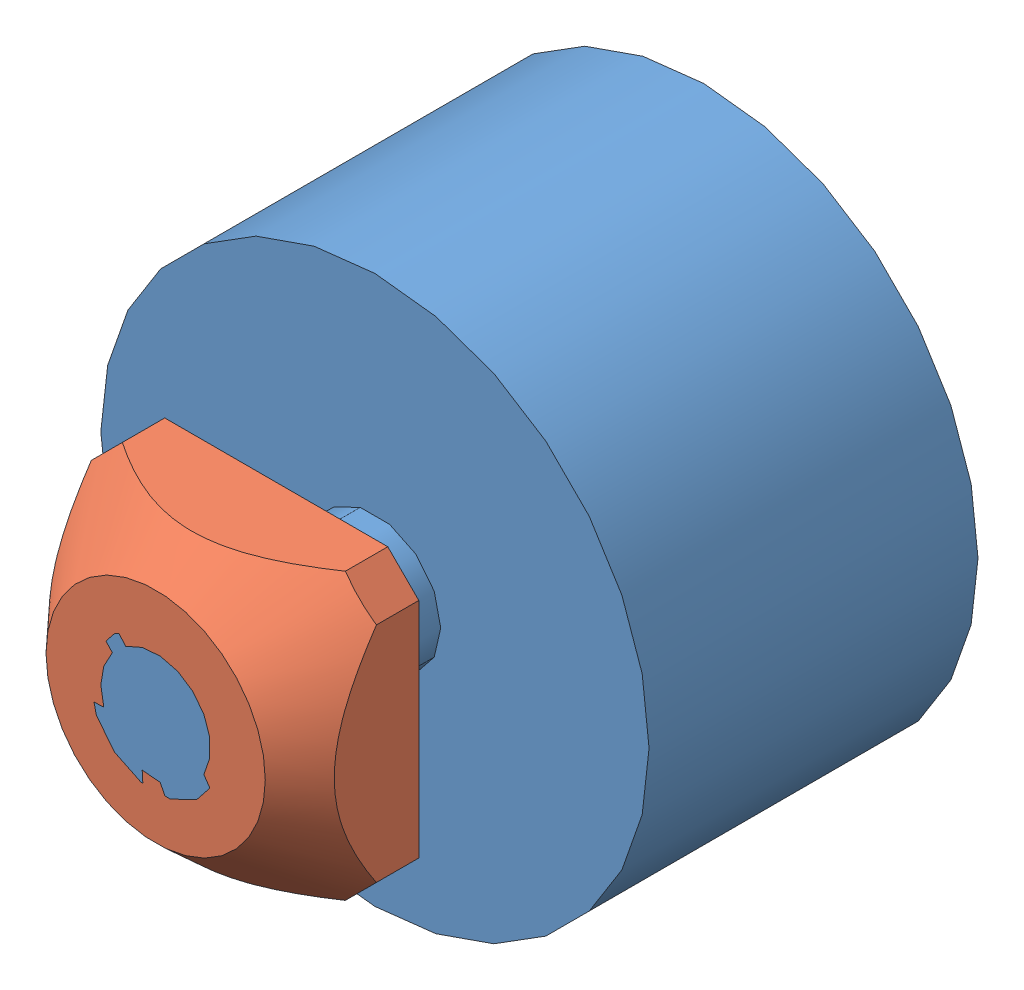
SolidWorks assembly 21.1759 STOPPER 25.SLDASM, configuration Default (file format 3800). Lengths in mm.
Overall size (25 25 25).
2 component instances, 2 part files, 3 mates.
Components (placement in the parent):
- 21.1759 STOPPER 25-1: 21.1759 STOPPER 25.SLDPRT [Default] at origin size (25 25 25)
- 21.1330 M6 SQUARE NUT-1: 21.1330 M6 SQUARE NUT.SLDPRT [Default] at (0 0 4.5) x (-1 0 0) z (0 0 -1) size (13 13 5.5)
Mates (geometry in assembly coordinates):
- Coincident1: coincident aligned: axis of ?; axis of 21.1759 STOPPER 25-1
- Distance1: distance = 4.5 mm anti-aligned: plane of 21.1759 STOPPER 25-1 through (0 0 0) normal (0 0 1); plane of 21.1330 M6 SQUARE NUT-1 through (0 0 4.5) normal (0 0 -1)
- Angle1: planar angle aligned: unknown of 21.1330 M6 SQUARE NUT-1
